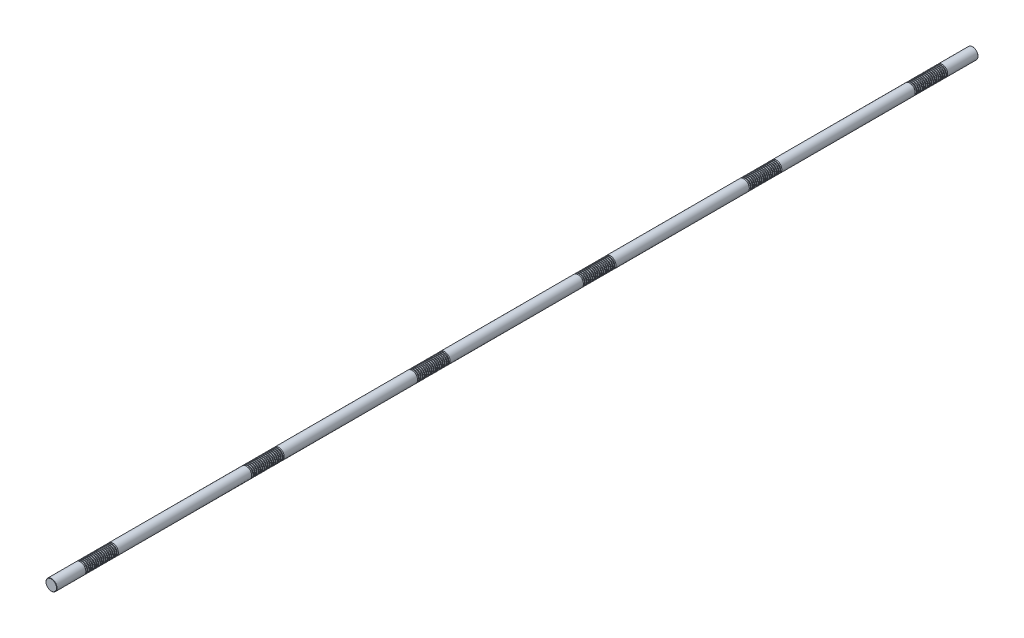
from build123d import *

# Parameters (mm, degrees)
SKETCH1_R           = 18
BOSS_EXTRUDE1_DEPTH = 1500
CHAMFER1_SIZE       = 0.9
LPATTERN1_COUNT     = 18
LPATTERN1_PITCH     = 6
LPATTERN2_COUNT     = 6
LPATTERN2_PITCH     = 540


with BuildPart() as part:
    # Sketch1 → Boss-Extrude1 (new, symmetric)
    with BuildSketch(Plane.XY):
        Circle(SKETCH1_R)
    extrude(amount=BOSS_EXTRUDE1_DEPTH, both=True)

    # Chamfer1
    chamfer1_edges = [part.edges().sort_by_distance(p)[0] for p in [
        (-18, 0, -1500),
        (-18, 0, 1500),
    ]]
    chamfer(chamfer1_edges, length=CHAMFER1_SIZE)

    # Sketch2 → Cut-Revolve1 (revolve, cut)
    with BuildSketch(Plane(origin=(0, 0, 0), x_dir=(0, 0, -1), z_dir=(1, 0, 0)), mode=Mode.PRIVATE) as cut_revolve1_sk:
        Polygon((1400.468911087, 18), (1396.531088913, 18), (1397.468911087, 14.5), (1399.531088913, 14.5), align=None)
    cut_revolve1 = revolve(cut_revolve1_sk.sketch.rotate(Axis((0, 0, 1500), (0, 0, -1)), 90), axis=Axis((0, 0, 1500), (0, 0, -1)), mode=Mode.SUBTRACT)

    # LPattern1: Cut-Revolve1 ×18
    with Locations(*[(0, 0, i * LPATTERN1_PITCH) for i in range(1, LPATTERN1_COUNT)]):
        add(cut_revolve1, mode=Mode.SUBTRACT)

    # LPattern2: Cut-Revolve1 ×6
    with Locations(*[(0, 0, i * LPATTERN2_PITCH) for i in range(1, LPATTERN2_COUNT)]):
        add(cut_revolve1, mode=Mode.SUBTRACT)

    # LPattern2 copy 1 sketch → LPattern2 copy 1 (revolve, cut)
    with BuildSketch(Plane(origin=(0, 0, 546), x_dir=(0, 0, -1), z_dir=(1, 0, 0))):
        Polygon((1400.468911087, 18), (1396.531088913, 18), (1397.468911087, 14.5), (1399.531088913, 14.5), align=None)
    revolve(axis=Axis((0, 0, 2046), (0, 0, -1)), mode=Mode.SUBTRACT)

    # LPattern2 copy 2 sketch → LPattern2 copy 2 (revolve, cut)
    with BuildSketch(Plane(origin=(0, 0, 1086), x_dir=(0, 0, -1), z_dir=(1, 0, 0))):
        Polygon((1400.468911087, 18), (1396.531088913, 18), (1397.468911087, 14.5), (1399.531088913, 14.5), align=None)
    revolve(axis=Axis((0, 0, 2586), (0, 0, -1)), mode=Mode.SUBTRACT)

    # LPattern2 copy 3 sketch → LPattern2 copy 3 (revolve, cut)
    with BuildSketch(Plane(origin=(0, 0, 1626), x_dir=(0, 0, -1), z_dir=(1, 0, 0))):
        Polygon((1400.468911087, 18), (1396.531088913, 18), (1397.468911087, 14.5), (1399.531088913, 14.5), align=None)
    revolve(axis=Axis((0, 0, 3126), (0, 0, -1)), mode=Mode.SUBTRACT)

    # LPattern2 copy 4 sketch → LPattern2 copy 4 (revolve, cut)
    with BuildSketch(Plane(origin=(0, 0, 2166), x_dir=(0, 0, -1), z_dir=(1, 0, 0))):
        Polygon((1400.468911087, 18), (1396.531088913, 18), (1397.468911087, 14.5), (1399.531088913, 14.5), align=None)
    revolve(axis=Axis((0, 0, 3666), (0, 0, -1)), mode=Mode.SUBTRACT)

    # LPattern2 copy 5 sketch → LPattern2 copy 5 (revolve, cut)
    with BuildSketch(Plane(origin=(0, 0, 2706), x_dir=(0, 0, -1), z_dir=(1, 0, 0))):
        Polygon((1400.468911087, 18), (1396.531088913, 18), (1397.468911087, 14.5), (1399.531088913, 14.5), align=None)
    revolve(axis=Axis((0, 0, 4206), (0, 0, -1)), mode=Mode.SUBTRACT)

    # LPattern2 copy 6 sketch → LPattern2 copy 6 (revolve, cut)
    with BuildSketch(Plane(origin=(0, 0, 552), x_dir=(0, 0, -1), z_dir=(1, 0, 0))):
        Polygon((1400.468911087, 18), (1396.531088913, 18), (1397.468911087, 14.5), (1399.531088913, 14.5), align=None)
    revolve(axis=Axis((0, 0, 2052), (0, 0, -1)), mode=Mode.SUBTRACT)

    # LPattern2 copy 7 sketch → LPattern2 copy 7 (revolve, cut)
    with BuildSketch(Plane(origin=(0, 0, 1092), x_dir=(0, 0, -1), z_dir=(1, 0, 0))):
        Polygon((1400.468911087, 18), (1396.531088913, 18), (1397.468911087, 14.5), (1399.531088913, 14.5), align=None)
    revolve(axis=Axis((0, 0, 2592), (0, 0, -1)), mode=Mode.SUBTRACT)

    # LPattern2 copy 8 sketch → LPattern2 copy 8 (revolve, cut)
    with BuildSketch(Plane(origin=(0, 0, 1632), x_dir=(0, 0, -1), z_dir=(1, 0, 0))):
        Polygon((1400.468911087, 18), (1396.531088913, 18), (1397.468911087, 14.5), (1399.531088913, 14.5), align=None)
    revolve(axis=Axis((0, 0, 3132), (0, 0, -1)), mode=Mode.SUBTRACT)

    # LPattern2 copy 9 sketch → LPattern2 copy 9 (revolve, cut)
    with BuildSketch(Plane(origin=(0, 0, 2172), x_dir=(0, 0, -1), z_dir=(1, 0, 0))):
        Polygon((1400.468911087, 18), (1396.531088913, 18), (1397.468911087, 14.5), (1399.531088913, 14.5), align=None)
    revolve(axis=Axis((0, 0, 3672), (0, 0, -1)), mode=Mode.SUBTRACT)

    # LPattern2 copy 10 sketch → LPattern2 copy 10 (revolve, cut)
    with BuildSketch(Plane(origin=(0, 0, 2712), x_dir=(0, 0, -1), z_dir=(1, 0, 0))):
        Polygon((1400.468911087, 18), (1396.531088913, 18), (1397.468911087, 14.5), (1399.531088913, 14.5), align=None)
    revolve(axis=Axis((0, 0, 4212), (0, 0, -1)), mode=Mode.SUBTRACT)

    # LPattern2 copy 11 sketch → LPattern2 copy 11 (revolve, cut)
    with BuildSketch(Plane(origin=(0, 0, 558), x_dir=(0, 0, -1), z_dir=(1, 0, 0))):
        Polygon((1400.468911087, 18), (1396.531088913, 18), (1397.468911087, 14.5), (1399.531088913, 14.5), align=None)
    revolve(axis=Axis((0, 0, 2058), (0, 0, -1)), mode=Mode.SUBTRACT)

    # LPattern2 copy 12 sketch → LPattern2 copy 12 (revolve, cut)
    with BuildSketch(Plane(origin=(0, 0, 1098), x_dir=(0, 0, -1), z_dir=(1, 0, 0))):
        Polygon((1400.468911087, 18), (1396.531088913, 18), (1397.468911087, 14.5), (1399.531088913, 14.5), align=None)
    revolve(axis=Axis((0, 0, 2598), (0, 0, -1)), mode=Mode.SUBTRACT)

    # LPattern2 copy 13 sketch → LPattern2 copy 13 (revolve, cut)
    with BuildSketch(Plane(origin=(0, 0, 1638), x_dir=(0, 0, -1), z_dir=(1, 0, 0))):
        Polygon((1400.468911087, 18), (1396.531088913, 18), (1397.468911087, 14.5), (1399.531088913, 14.5), align=None)
    revolve(axis=Axis((0, 0, 3138), (0, 0, -1)), mode=Mode.SUBTRACT)

    # LPattern2 copy 14 sketch → LPattern2 copy 14 (revolve, cut)
    with BuildSketch(Plane(origin=(0, 0, 2178), x_dir=(0, 0, -1), z_dir=(1, 0, 0))):
        Polygon((1400.468911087, 18), (1396.531088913, 18), (1397.468911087, 14.5), (1399.531088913, 14.5), align=None)
    revolve(axis=Axis((0, 0, 3678), (0, 0, -1)), mode=Mode.SUBTRACT)

    # LPattern2 copy 15 sketch → LPattern2 copy 15 (revolve, cut)
    with BuildSketch(Plane(origin=(0, 0, 2718), x_dir=(0, 0, -1), z_dir=(1, 0, 0))):
        Polygon((1400.468911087, 18), (1396.531088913, 18), (1397.468911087, 14.5), (1399.531088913, 14.5), align=None)
    revolve(axis=Axis((0, 0, 4218), (0, 0, -1)), mode=Mode.SUBTRACT)

    # LPattern2 copy 16 sketch → LPattern2 copy 16 (revolve, cut)
    with BuildSketch(Plane(origin=(0, 0, 564), x_dir=(0, 0, -1), z_dir=(1, 0, 0))):
        Polygon((1400.468911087, 18), (1396.531088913, 18), (1397.468911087, 14.5), (1399.531088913, 14.5), align=None)
    revolve(axis=Axis((0, 0, 2064), (0, 0, -1)), mode=Mode.SUBTRACT)

    # LPattern2 copy 17 sketch → LPattern2 copy 17 (revolve, cut)
    with BuildSketch(Plane(origin=(0, 0, 1104), x_dir=(0, 0, -1), z_dir=(1, 0, 0))):
        Polygon((1400.468911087, 18), (1396.531088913, 18), (1397.468911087, 14.5), (1399.531088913, 14.5), align=None)
    revolve(axis=Axis((0, 0, 2604), (0, 0, -1)), mode=Mode.SUBTRACT)

    # LPattern2 copy 18 sketch → LPattern2 copy 18 (revolve, cut)
    with BuildSketch(Plane(origin=(0, 0, 1644), x_dir=(0, 0, -1), z_dir=(1, 0, 0))):
        Polygon((1400.468911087, 18), (1396.531088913, 18), (1397.468911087, 14.5), (1399.531088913, 14.5), align=None)
    revolve(axis=Axis((0, 0, 3144), (0, 0, -1)), mode=Mode.SUBTRACT)

    # LPattern2 copy 19 sketch → LPattern2 copy 19 (revolve, cut)
    with BuildSketch(Plane(origin=(0, 0, 2184), x_dir=(0, 0, -1), z_dir=(1, 0, 0))):
        Polygon((1400.468911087, 18), (1396.531088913, 18), (1397.468911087, 14.5), (1399.531088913, 14.5), align=None)
    revolve(axis=Axis((0, 0, 3684), (0, 0, -1)), mode=Mode.SUBTRACT)

    # LPattern2 copy 20 sketch → LPattern2 copy 20 (revolve, cut)
    with BuildSketch(Plane(origin=(0, 0, 2724), x_dir=(0, 0, -1), z_dir=(1, 0, 0))):
        Polygon((1400.468911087, 18), (1396.531088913, 18), (1397.468911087, 14.5), (1399.531088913, 14.5), align=None)
    revolve(axis=Axis((0, 0, 4224), (0, 0, -1)), mode=Mode.SUBTRACT)

    # LPattern2 copy 21 sketch → LPattern2 copy 21 (revolve, cut)
    with BuildSketch(Plane(origin=(0, 0, 570), x_dir=(0, 0, -1), z_dir=(1, 0, 0))):
        Polygon((1400.468911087, 18), (1396.531088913, 18), (1397.468911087, 14.5), (1399.531088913, 14.5), align=None)
    revolve(axis=Axis((0, 0, 2070), (0, 0, -1)), mode=Mode.SUBTRACT)

    # LPattern2 copy 22 sketch → LPattern2 copy 22 (revolve, cut)
    with BuildSketch(Plane(origin=(0, 0, 1110), x_dir=(0, 0, -1), z_dir=(1, 0, 0))):
        Polygon((1400.468911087, 18), (1396.531088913, 18), (1397.468911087, 14.5), (1399.531088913, 14.5), align=None)
    revolve(axis=Axis((0, 0, 2610), (0, 0, -1)), mode=Mode.SUBTRACT)

    # LPattern2 copy 23 sketch → LPattern2 copy 23 (revolve, cut)
    with BuildSketch(Plane(origin=(0, 0, 1650), x_dir=(0, 0, -1), z_dir=(1, 0, 0))):
        Polygon((1400.468911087, 18), (1396.531088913, 18), (1397.468911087, 14.5), (1399.531088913, 14.5), align=None)
    revolve(axis=Axis((0, 0, 3150), (0, 0, -1)), mode=Mode.SUBTRACT)

    # LPattern2 copy 24 sketch → LPattern2 copy 24 (revolve, cut)
    with BuildSketch(Plane(origin=(0, 0, 2190), x_dir=(0, 0, -1), z_dir=(1, 0, 0))):
        Polygon((1400.468911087, 18), (1396.531088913, 18), (1397.468911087, 14.5), (1399.531088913, 14.5), align=None)
    revolve(axis=Axis((0, 0, 3690), (0, 0, -1)), mode=Mode.SUBTRACT)

    # LPattern2 copy 25 sketch → LPattern2 copy 25 (revolve, cut)
    with BuildSketch(Plane(origin=(0, 0, 2730), x_dir=(0, 0, -1), z_dir=(1, 0, 0))):
        Polygon((1400.468911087, 18), (1396.531088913, 18), (1397.468911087, 14.5), (1399.531088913, 14.5), align=None)
    revolve(axis=Axis((0, 0, 4230), (0, 0, -1)), mode=Mode.SUBTRACT)

    # LPattern2 copy 26 sketch → LPattern2 copy 26 (revolve, cut)
    with BuildSketch(Plane(origin=(0, 0, 576), x_dir=(0, 0, -1), z_dir=(1, 0, 0))):
        Polygon((1400.468911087, 18), (1396.531088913, 18), (1397.468911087, 14.5), (1399.531088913, 14.5), align=None)
    revolve(axis=Axis((0, 0, 2076), (0, 0, -1)), mode=Mode.SUBTRACT)

    # LPattern2 copy 27 sketch → LPattern2 copy 27 (revolve, cut)
    with BuildSketch(Plane(origin=(0, 0, 1116), x_dir=(0, 0, -1), z_dir=(1, 0, 0))):
        Polygon((1400.468911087, 18), (1396.531088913, 18), (1397.468911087, 14.5), (1399.531088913, 14.5), align=None)
    revolve(axis=Axis((0, 0, 2616), (0, 0, -1)), mode=Mode.SUBTRACT)

    # LPattern2 copy 28 sketch → LPattern2 copy 28 (revolve, cut)
    with BuildSketch(Plane(origin=(0, 0, 1656), x_dir=(0, 0, -1), z_dir=(1, 0, 0))):
        Polygon((1400.468911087, 18), (1396.531088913, 18), (1397.468911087, 14.5), (1399.531088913, 14.5), align=None)
    revolve(axis=Axis((0, 0, 3156), (0, 0, -1)), mode=Mode.SUBTRACT)

    # LPattern2 copy 29 sketch → LPattern2 copy 29 (revolve, cut)
    with BuildSketch(Plane(origin=(0, 0, 2196), x_dir=(0, 0, -1), z_dir=(1, 0, 0))):
        Polygon((1400.468911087, 18), (1396.531088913, 18), (1397.468911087, 14.5), (1399.531088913, 14.5), align=None)
    revolve(axis=Axis((0, 0, 3696), (0, 0, -1)), mode=Mode.SUBTRACT)

    # LPattern2 copy 30 sketch → LPattern2 copy 30 (revolve, cut)
    with BuildSketch(Plane(origin=(0, 0, 2736), x_dir=(0, 0, -1), z_dir=(1, 0, 0))):
        Polygon((1400.468911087, 18), (1396.531088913, 18), (1397.468911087, 14.5), (1399.531088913, 14.5), align=None)
    revolve(axis=Axis((0, 0, 4236), (0, 0, -1)), mode=Mode.SUBTRACT)

    # LPattern2 copy 31 sketch → LPattern2 copy 31 (revolve, cut)
    with BuildSketch(Plane(origin=(0, 0, 582), x_dir=(0, 0, -1), z_dir=(1, 0, 0))):
        Polygon((1400.468911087, 18), (1396.531088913, 18), (1397.468911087, 14.5), (1399.531088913, 14.5), align=None)
    revolve(axis=Axis((0, 0, 2082), (0, 0, -1)), mode=Mode.SUBTRACT)

    # LPattern2 copy 32 sketch → LPattern2 copy 32 (revolve, cut)
    with BuildSketch(Plane(origin=(0, 0, 1122), x_dir=(0, 0, -1), z_dir=(1, 0, 0))):
        Polygon((1400.468911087, 18), (1396.531088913, 18), (1397.468911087, 14.5), (1399.531088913, 14.5), align=None)
    revolve(axis=Axis((0, 0, 2622), (0, 0, -1)), mode=Mode.SUBTRACT)

    # LPattern2 copy 33 sketch → LPattern2 copy 33 (revolve, cut)
    with BuildSketch(Plane(origin=(0, 0, 1662), x_dir=(0, 0, -1), z_dir=(1, 0, 0))):
        Polygon((1400.468911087, 18), (1396.531088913, 18), (1397.468911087, 14.5), (1399.531088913, 14.5), align=None)
    revolve(axis=Axis((0, 0, 3162), (0, 0, -1)), mode=Mode.SUBTRACT)

    # LPattern2 copy 34 sketch → LPattern2 copy 34 (revolve, cut)
    with BuildSketch(Plane(origin=(0, 0, 2202), x_dir=(0, 0, -1), z_dir=(1, 0, 0))):
        Polygon((1400.468911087, 18), (1396.531088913, 18), (1397.468911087, 14.5), (1399.531088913, 14.5), align=None)
    revolve(axis=Axis((0, 0, 3702), (0, 0, -1)), mode=Mode.SUBTRACT)

    # LPattern2 copy 35 sketch → LPattern2 copy 35 (revolve, cut)
    with BuildSketch(Plane(origin=(0, 0, 2742), x_dir=(0, 0, -1), z_dir=(1, 0, 0))):
        Polygon((1400.468911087, 18), (1396.531088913, 18), (1397.468911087, 14.5), (1399.531088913, 14.5), align=None)
    revolve(axis=Axis((0, 0, 4242), (0, 0, -1)), mode=Mode.SUBTRACT)

    # LPattern2 copy 36 sketch → LPattern2 copy 36 (revolve, cut)
    with BuildSketch(Plane(origin=(0, 0, 588), x_dir=(0, 0, -1), z_dir=(1, 0, 0))):
        Polygon((1400.468911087, 18), (1396.531088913, 18), (1397.468911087, 14.5), (1399.531088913, 14.5), align=None)
    revolve(axis=Axis((0, 0, 2088), (0, 0, -1)), mode=Mode.SUBTRACT)

    # LPattern2 copy 37 sketch → LPattern2 copy 37 (revolve, cut)
    with BuildSketch(Plane(origin=(0, 0, 1128), x_dir=(0, 0, -1), z_dir=(1, 0, 0))):
        Polygon((1400.468911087, 18), (1396.531088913, 18), (1397.468911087, 14.5), (1399.531088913, 14.5), align=None)
    revolve(axis=Axis((0, 0, 2628), (0, 0, -1)), mode=Mode.SUBTRACT)

    # LPattern2 copy 38 sketch → LPattern2 copy 38 (revolve, cut)
    with BuildSketch(Plane(origin=(0, 0, 1668), x_dir=(0, 0, -1), z_dir=(1, 0, 0))):
        Polygon((1400.468911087, 18), (1396.531088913, 18), (1397.468911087, 14.5), (1399.531088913, 14.5), align=None)
    revolve(axis=Axis((0, 0, 3168), (0, 0, -1)), mode=Mode.SUBTRACT)

    # LPattern2 copy 39 sketch → LPattern2 copy 39 (revolve, cut)
    with BuildSketch(Plane(origin=(0, 0, 2208), x_dir=(0, 0, -1), z_dir=(1, 0, 0))):
        Polygon((1400.468911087, 18), (1396.531088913, 18), (1397.468911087, 14.5), (1399.531088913, 14.5), align=None)
    revolve(axis=Axis((0, 0, 3708), (0, 0, -1)), mode=Mode.SUBTRACT)

    # LPattern2 copy 40 sketch → LPattern2 copy 40 (revolve, cut)
    with BuildSketch(Plane(origin=(0, 0, 2748), x_dir=(0, 0, -1), z_dir=(1, 0, 0))):
        Polygon((1400.468911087, 18), (1396.531088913, 18), (1397.468911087, 14.5), (1399.531088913, 14.5), align=None)
    revolve(axis=Axis((0, 0, 4248), (0, 0, -1)), mode=Mode.SUBTRACT)

    # LPattern2 copy 41 sketch → LPattern2 copy 41 (revolve, cut)
    with BuildSketch(Plane(origin=(0, 0, 594), x_dir=(0, 0, -1), z_dir=(1, 0, 0))):
        Polygon((1400.468911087, 18), (1396.531088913, 18), (1397.468911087, 14.5), (1399.531088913, 14.5), align=None)
    revolve(axis=Axis((0, 0, 2094), (0, 0, -1)), mode=Mode.SUBTRACT)

    # LPattern2 copy 42 sketch → LPattern2 copy 42 (revolve, cut)
    with BuildSketch(Plane(origin=(0, 0, 1134), x_dir=(0, 0, -1), z_dir=(1, 0, 0))):
        Polygon((1400.468911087, 18), (1396.531088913, 18), (1397.468911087, 14.5), (1399.531088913, 14.5), align=None)
    revolve(axis=Axis((0, 0, 2634), (0, 0, -1)), mode=Mode.SUBTRACT)

    # LPattern2 copy 43 sketch → LPattern2 copy 43 (revolve, cut)
    with BuildSketch(Plane(origin=(0, 0, 1674), x_dir=(0, 0, -1), z_dir=(1, 0, 0))):
        Polygon((1400.468911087, 18), (1396.531088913, 18), (1397.468911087, 14.5), (1399.531088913, 14.5), align=None)
    revolve(axis=Axis((0, 0, 3174), (0, 0, -1)), mode=Mode.SUBTRACT)

    # LPattern2 copy 44 sketch → LPattern2 copy 44 (revolve, cut)
    with BuildSketch(Plane(origin=(0, 0, 2214), x_dir=(0, 0, -1), z_dir=(1, 0, 0))):
        Polygon((1400.468911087, 18), (1396.531088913, 18), (1397.468911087, 14.5), (1399.531088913, 14.5), align=None)
    revolve(axis=Axis((0, 0, 3714), (0, 0, -1)), mode=Mode.SUBTRACT)

    # LPattern2 copy 45 sketch → LPattern2 copy 45 (revolve, cut)
    with BuildSketch(Plane(origin=(0, 0, 2754), x_dir=(0, 0, -1), z_dir=(1, 0, 0))):
        Polygon((1400.468911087, 18), (1396.531088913, 18), (1397.468911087, 14.5), (1399.531088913, 14.5), align=None)
    revolve(axis=Axis((0, 0, 4254), (0, 0, -1)), mode=Mode.SUBTRACT)

    # LPattern2 copy 46 sketch → LPattern2 copy 46 (revolve, cut)
    with BuildSketch(Plane(origin=(0, 0, 600), x_dir=(0, 0, -1), z_dir=(1, 0, 0))):
        Polygon((1400.468911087, 18), (1396.531088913, 18), (1397.468911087, 14.5), (1399.531088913, 14.5), align=None)
    revolve(axis=Axis((0, 0, 2100), (0, 0, -1)), mode=Mode.SUBTRACT)

    # LPattern2 copy 47 sketch → LPattern2 copy 47 (revolve, cut)
    with BuildSketch(Plane(origin=(0, 0, 1140), x_dir=(0, 0, -1), z_dir=(1, 0, 0))):
        Polygon((1400.468911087, 18), (1396.531088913, 18), (1397.468911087, 14.5), (1399.531088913, 14.5), align=None)
    revolve(axis=Axis((0, 0, 2640), (0, 0, -1)), mode=Mode.SUBTRACT)

    # LPattern2 copy 48 sketch → LPattern2 copy 48 (revolve, cut)
    with BuildSketch(Plane(origin=(0, 0, 1680), x_dir=(0, 0, -1), z_dir=(1, 0, 0))):
        Polygon((1400.468911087, 18), (1396.531088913, 18), (1397.468911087, 14.5), (1399.531088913, 14.5), align=None)
    revolve(axis=Axis((0, 0, 3180), (0, 0, -1)), mode=Mode.SUBTRACT)

    # LPattern2 copy 49 sketch → LPattern2 copy 49 (revolve, cut)
    with BuildSketch(Plane(origin=(0, 0, 2220), x_dir=(0, 0, -1), z_dir=(1, 0, 0))):
        Polygon((1400.468911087, 18), (1396.531088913, 18), (1397.468911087, 14.5), (1399.531088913, 14.5), align=None)
    revolve(axis=Axis((0, 0, 3720), (0, 0, -1)), mode=Mode.SUBTRACT)

    # LPattern2 copy 50 sketch → LPattern2 copy 50 (revolve, cut)
    with BuildSketch(Plane(origin=(0, 0, 2760), x_dir=(0, 0, -1), z_dir=(1, 0, 0))):
        Polygon((1400.468911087, 18), (1396.531088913, 18), (1397.468911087, 14.5), (1399.531088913, 14.5), align=None)
    revolve(axis=Axis((0, 0, 4260), (0, 0, -1)), mode=Mode.SUBTRACT)

    # LPattern2 copy 51 sketch → LPattern2 copy 51 (revolve, cut)
    with BuildSketch(Plane(origin=(0, 0, 606), x_dir=(0, 0, -1), z_dir=(1, 0, 0))):
        Polygon((1400.468911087, 18), (1396.531088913, 18), (1397.468911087, 14.5), (1399.531088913, 14.5), align=None)
    revolve(axis=Axis((0, 0, 2106), (0, 0, -1)), mode=Mode.SUBTRACT)

    # LPattern2 copy 52 sketch → LPattern2 copy 52 (revolve, cut)
    with BuildSketch(Plane(origin=(0, 0, 1146), x_dir=(0, 0, -1), z_dir=(1, 0, 0))):
        Polygon((1400.468911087, 18), (1396.531088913, 18), (1397.468911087, 14.5), (1399.531088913, 14.5), align=None)
    revolve(axis=Axis((0, 0, 2646), (0, 0, -1)), mode=Mode.SUBTRACT)

    # LPattern2 copy 53 sketch → LPattern2 copy 53 (revolve, cut)
    with BuildSketch(Plane(origin=(0, 0, 1686), x_dir=(0, 0, -1), z_dir=(1, 0, 0))):
        Polygon((1400.468911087, 18), (1396.531088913, 18), (1397.468911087, 14.5), (1399.531088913, 14.5), align=None)
    revolve(axis=Axis((0, 0, 3186), (0, 0, -1)), mode=Mode.SUBTRACT)

    # LPattern2 copy 54 sketch → LPattern2 copy 54 (revolve, cut)
    with BuildSketch(Plane(origin=(0, 0, 2226), x_dir=(0, 0, -1), z_dir=(1, 0, 0))):
        Polygon((1400.468911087, 18), (1396.531088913, 18), (1397.468911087, 14.5), (1399.531088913, 14.5), align=None)
    revolve(axis=Axis((0, 0, 3726), (0, 0, -1)), mode=Mode.SUBTRACT)

    # LPattern2 copy 55 sketch → LPattern2 copy 55 (revolve, cut)
    with BuildSketch(Plane(origin=(0, 0, 2766), x_dir=(0, 0, -1), z_dir=(1, 0, 0))):
        Polygon((1400.468911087, 18), (1396.531088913, 18), (1397.468911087, 14.5), (1399.531088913, 14.5), align=None)
    revolve(axis=Axis((0, 0, 4266), (0, 0, -1)), mode=Mode.SUBTRACT)

    # LPattern2 copy 56 sketch → LPattern2 copy 56 (revolve, cut)
    with BuildSketch(Plane(origin=(0, 0, 612), x_dir=(0, 0, -1), z_dir=(1, 0, 0))):
        Polygon((1400.468911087, 18), (1396.531088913, 18), (1397.468911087, 14.5), (1399.531088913, 14.5), align=None)
    revolve(axis=Axis((0, 0, 2112), (0, 0, -1)), mode=Mode.SUBTRACT)

    # LPattern2 copy 57 sketch → LPattern2 copy 57 (revolve, cut)
    with BuildSketch(Plane(origin=(0, 0, 1152), x_dir=(0, 0, -1), z_dir=(1, 0, 0))):
        Polygon((1400.468911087, 18), (1396.531088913, 18), (1397.468911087, 14.5), (1399.531088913, 14.5), align=None)
    revolve(axis=Axis((0, 0, 2652), (0, 0, -1)), mode=Mode.SUBTRACT)

    # LPattern2 copy 58 sketch → LPattern2 copy 58 (revolve, cut)
    with BuildSketch(Plane(origin=(0, 0, 1692), x_dir=(0, 0, -1), z_dir=(1, 0, 0))):
        Polygon((1400.468911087, 18), (1396.531088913, 18), (1397.468911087, 14.5), (1399.531088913, 14.5), align=None)
    revolve(axis=Axis((0, 0, 3192), (0, 0, -1)), mode=Mode.SUBTRACT)

    # LPattern2 copy 59 sketch → LPattern2 copy 59 (revolve, cut)
    with BuildSketch(Plane(origin=(0, 0, 2232), x_dir=(0, 0, -1), z_dir=(1, 0, 0))):
        Polygon((1400.468911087, 18), (1396.531088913, 18), (1397.468911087, 14.5), (1399.531088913, 14.5), align=None)
    revolve(axis=Axis((0, 0, 3732), (0, 0, -1)), mode=Mode.SUBTRACT)

    # LPattern2 copy 60 sketch → LPattern2 copy 60 (revolve, cut)
    with BuildSketch(Plane(origin=(0, 0, 2772), x_dir=(0, 0, -1), z_dir=(1, 0, 0))):
        Polygon((1400.468911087, 18), (1396.531088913, 18), (1397.468911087, 14.5), (1399.531088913, 14.5), align=None)
    revolve(axis=Axis((0, 0, 4272), (0, 0, -1)), mode=Mode.SUBTRACT)

    # LPattern2 copy 61 sketch → LPattern2 copy 61 (revolve, cut)
    with BuildSketch(Plane(origin=(0, 0, 618), x_dir=(0, 0, -1), z_dir=(1, 0, 0))):
        Polygon((1400.468911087, 18), (1396.531088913, 18), (1397.468911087, 14.5), (1399.531088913, 14.5), align=None)
    revolve(axis=Axis((0, 0, 2118), (0, 0, -1)), mode=Mode.SUBTRACT)

    # LPattern2 copy 62 sketch → LPattern2 copy 62 (revolve, cut)
    with BuildSketch(Plane(origin=(0, 0, 1158), x_dir=(0, 0, -1), z_dir=(1, 0, 0))):
        Polygon((1400.468911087, 18), (1396.531088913, 18), (1397.468911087, 14.5), (1399.531088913, 14.5), align=None)
    revolve(axis=Axis((0, 0, 2658), (0, 0, -1)), mode=Mode.SUBTRACT)

    # LPattern2 copy 63 sketch → LPattern2 copy 63 (revolve, cut)
    with BuildSketch(Plane(origin=(0, 0, 1698), x_dir=(0, 0, -1), z_dir=(1, 0, 0))):
        Polygon((1400.468911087, 18), (1396.531088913, 18), (1397.468911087, 14.5), (1399.531088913, 14.5), align=None)
    revolve(axis=Axis((0, 0, 3198), (0, 0, -1)), mode=Mode.SUBTRACT)

    # LPattern2 copy 64 sketch → LPattern2 copy 64 (revolve, cut)
    with BuildSketch(Plane(origin=(0, 0, 2238), x_dir=(0, 0, -1), z_dir=(1, 0, 0))):
        Polygon((1400.468911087, 18), (1396.531088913, 18), (1397.468911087, 14.5), (1399.531088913, 14.5), align=None)
    revolve(axis=Axis((0, 0, 3738), (0, 0, -1)), mode=Mode.SUBTRACT)

    # LPattern2 copy 65 sketch → LPattern2 copy 65 (revolve, cut)
    with BuildSketch(Plane(origin=(0, 0, 2778), x_dir=(0, 0, -1), z_dir=(1, 0, 0))):
        Polygon((1400.468911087, 18), (1396.531088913, 18), (1397.468911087, 14.5), (1399.531088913, 14.5), align=None)
    revolve(axis=Axis((0, 0, 4278), (0, 0, -1)), mode=Mode.SUBTRACT)

    # LPattern2 copy 66 sketch → LPattern2 copy 66 (revolve, cut)
    with BuildSketch(Plane(origin=(0, 0, 624), x_dir=(0, 0, -1), z_dir=(1, 0, 0))):
        Polygon((1400.468911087, 18), (1396.531088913, 18), (1397.468911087, 14.5), (1399.531088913, 14.5), align=None)
    revolve(axis=Axis((0, 0, 2124), (0, 0, -1)), mode=Mode.SUBTRACT)

    # LPattern2 copy 67 sketch → LPattern2 copy 67 (revolve, cut)
    with BuildSketch(Plane(origin=(0, 0, 1164), x_dir=(0, 0, -1), z_dir=(1, 0, 0))):
        Polygon((1400.468911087, 18), (1396.531088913, 18), (1397.468911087, 14.5), (1399.531088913, 14.5), align=None)
    revolve(axis=Axis((0, 0, 2664), (0, 0, -1)), mode=Mode.SUBTRACT)

    # LPattern2 copy 68 sketch → LPattern2 copy 68 (revolve, cut)
    with BuildSketch(Plane(origin=(0, 0, 1704), x_dir=(0, 0, -1), z_dir=(1, 0, 0))):
        Polygon((1400.468911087, 18), (1396.531088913, 18), (1397.468911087, 14.5), (1399.531088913, 14.5), align=None)
    revolve(axis=Axis((0, 0, 3204), (0, 0, -1)), mode=Mode.SUBTRACT)

    # LPattern2 copy 69 sketch → LPattern2 copy 69 (revolve, cut)
    with BuildSketch(Plane(origin=(0, 0, 2244), x_dir=(0, 0, -1), z_dir=(1, 0, 0))):
        Polygon((1400.468911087, 18), (1396.531088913, 18), (1397.468911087, 14.5), (1399.531088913, 14.5), align=None)
    revolve(axis=Axis((0, 0, 3744), (0, 0, -1)), mode=Mode.SUBTRACT)

    # LPattern2 copy 70 sketch → LPattern2 copy 70 (revolve, cut)
    with BuildSketch(Plane(origin=(0, 0, 2784), x_dir=(0, 0, -1), z_dir=(1, 0, 0))):
        Polygon((1400.468911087, 18), (1396.531088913, 18), (1397.468911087, 14.5), (1399.531088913, 14.5), align=None)
    revolve(axis=Axis((0, 0, 4284), (0, 0, -1)), mode=Mode.SUBTRACT)

    # LPattern2 copy 71 sketch → LPattern2 copy 71 (revolve, cut)
    with BuildSketch(Plane(origin=(0, 0, 630), x_dir=(0, 0, -1), z_dir=(1, 0, 0))):
        Polygon((1400.468911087, 18), (1396.531088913, 18), (1397.468911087, 14.5), (1399.531088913, 14.5), align=None)
    revolve(axis=Axis((0, 0, 2130), (0, 0, -1)), mode=Mode.SUBTRACT)

    # LPattern2 copy 72 sketch → LPattern2 copy 72 (revolve, cut)
    with BuildSketch(Plane(origin=(0, 0, 1170), x_dir=(0, 0, -1), z_dir=(1, 0, 0))):
        Polygon((1400.468911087, 18), (1396.531088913, 18), (1397.468911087, 14.5), (1399.531088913, 14.5), align=None)
    revolve(axis=Axis((0, 0, 2670), (0, 0, -1)), mode=Mode.SUBTRACT)

    # LPattern2 copy 73 sketch → LPattern2 copy 73 (revolve, cut)
    with BuildSketch(Plane(origin=(0, 0, 1710), x_dir=(0, 0, -1), z_dir=(1, 0, 0))):
        Polygon((1400.468911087, 18), (1396.531088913, 18), (1397.468911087, 14.5), (1399.531088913, 14.5), align=None)
    revolve(axis=Axis((0, 0, 3210), (0, 0, -1)), mode=Mode.SUBTRACT)

    # LPattern2 copy 74 sketch → LPattern2 copy 74 (revolve, cut)
    with BuildSketch(Plane(origin=(0, 0, 2250), x_dir=(0, 0, -1), z_dir=(1, 0, 0))):
        Polygon((1400.468911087, 18), (1396.531088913, 18), (1397.468911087, 14.5), (1399.531088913, 14.5), align=None)
    revolve(axis=Axis((0, 0, 3750), (0, 0, -1)), mode=Mode.SUBTRACT)

    # LPattern2 copy 75 sketch → LPattern2 copy 75 (revolve, cut)
    with BuildSketch(Plane(origin=(0, 0, 2790), x_dir=(0, 0, -1), z_dir=(1, 0, 0))):
        Polygon((1400.468911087, 18), (1396.531088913, 18), (1397.468911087, 14.5), (1399.531088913, 14.5), align=None)
    revolve(axis=Axis((0, 0, 4290), (0, 0, -1)), mode=Mode.SUBTRACT)

    # LPattern2 copy 76 sketch → LPattern2 copy 76 (revolve, cut)
    with BuildSketch(Plane(origin=(0, 0, 636), x_dir=(0, 0, -1), z_dir=(1, 0, 0))):
        Polygon((1400.468911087, 18), (1396.531088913, 18), (1397.468911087, 14.5), (1399.531088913, 14.5), align=None)
    revolve(axis=Axis((0, 0, 2136), (0, 0, -1)), mode=Mode.SUBTRACT)

    # LPattern2 copy 77 sketch → LPattern2 copy 77 (revolve, cut)
    with BuildSketch(Plane(origin=(0, 0, 1176), x_dir=(0, 0, -1), z_dir=(1, 0, 0))):
        Polygon((1400.468911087, 18), (1396.531088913, 18), (1397.468911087, 14.5), (1399.531088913, 14.5), align=None)
    revolve(axis=Axis((0, 0, 2676), (0, 0, -1)), mode=Mode.SUBTRACT)

    # LPattern2 copy 78 sketch → LPattern2 copy 78 (revolve, cut)
    with BuildSketch(Plane(origin=(0, 0, 1716), x_dir=(0, 0, -1), z_dir=(1, 0, 0))):
        Polygon((1400.468911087, 18), (1396.531088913, 18), (1397.468911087, 14.5), (1399.531088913, 14.5), align=None)
    revolve(axis=Axis((0, 0, 3216), (0, 0, -1)), mode=Mode.SUBTRACT)

    # LPattern2 copy 79 sketch → LPattern2 copy 79 (revolve, cut)
    with BuildSketch(Plane(origin=(0, 0, 2256), x_dir=(0, 0, -1), z_dir=(1, 0, 0))):
        Polygon((1400.468911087, 18), (1396.531088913, 18), (1397.468911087, 14.5), (1399.531088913, 14.5), align=None)
    revolve(axis=Axis((0, 0, 3756), (0, 0, -1)), mode=Mode.SUBTRACT)

    # LPattern2 copy 80 sketch → LPattern2 copy 80 (revolve, cut)
    with BuildSketch(Plane(origin=(0, 0, 2796), x_dir=(0, 0, -1), z_dir=(1, 0, 0))):
        Polygon((1400.468911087, 18), (1396.531088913, 18), (1397.468911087, 14.5), (1399.531088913, 14.5), align=None)
    revolve(axis=Axis((0, 0, 4296), (0, 0, -1)), mode=Mode.SUBTRACT)

    # LPattern2 copy 81 sketch → LPattern2 copy 81 (revolve, cut)
    with BuildSketch(Plane(origin=(0, 0, 642), x_dir=(0, 0, -1), z_dir=(1, 0, 0))):
        Polygon((1400.468911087, 18), (1396.531088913, 18), (1397.468911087, 14.5), (1399.531088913, 14.5), align=None)
    revolve(axis=Axis((0, 0, 2142), (0, 0, -1)), mode=Mode.SUBTRACT)

    # LPattern2 copy 82 sketch → LPattern2 copy 82 (revolve, cut)
    with BuildSketch(Plane(origin=(0, 0, 1182), x_dir=(0, 0, -1), z_dir=(1, 0, 0))):
        Polygon((1400.468911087, 18), (1396.531088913, 18), (1397.468911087, 14.5), (1399.531088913, 14.5), align=None)
    revolve(axis=Axis((0, 0, 2682), (0, 0, -1)), mode=Mode.SUBTRACT)

    # LPattern2 copy 83 sketch → LPattern2 copy 83 (revolve, cut)
    with BuildSketch(Plane(origin=(0, 0, 1722), x_dir=(0, 0, -1), z_dir=(1, 0, 0))):
        Polygon((1400.468911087, 18), (1396.531088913, 18), (1397.468911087, 14.5), (1399.531088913, 14.5), align=None)
    revolve(axis=Axis((0, 0, 3222), (0, 0, -1)), mode=Mode.SUBTRACT)

    # LPattern2 copy 84 sketch → LPattern2 copy 84 (revolve, cut)
    with BuildSketch(Plane(origin=(0, 0, 2262), x_dir=(0, 0, -1), z_dir=(1, 0, 0))):
        Polygon((1400.468911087, 18), (1396.531088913, 18), (1397.468911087, 14.5), (1399.531088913, 14.5), align=None)
    revolve(axis=Axis((0, 0, 3762), (0, 0, -1)), mode=Mode.SUBTRACT)

    # LPattern2 copy 85 sketch → LPattern2 copy 85 (revolve, cut)
    with BuildSketch(Plane(origin=(0, 0, 2802), x_dir=(0, 0, -1), z_dir=(1, 0, 0))):
        Polygon((1400.468911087, 18), (1396.531088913, 18), (1397.468911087, 14.5), (1399.531088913, 14.5), align=None)
    revolve(axis=Axis((0, 0, 4302), (0, 0, -1)), mode=Mode.SUBTRACT)


solid = part.part
